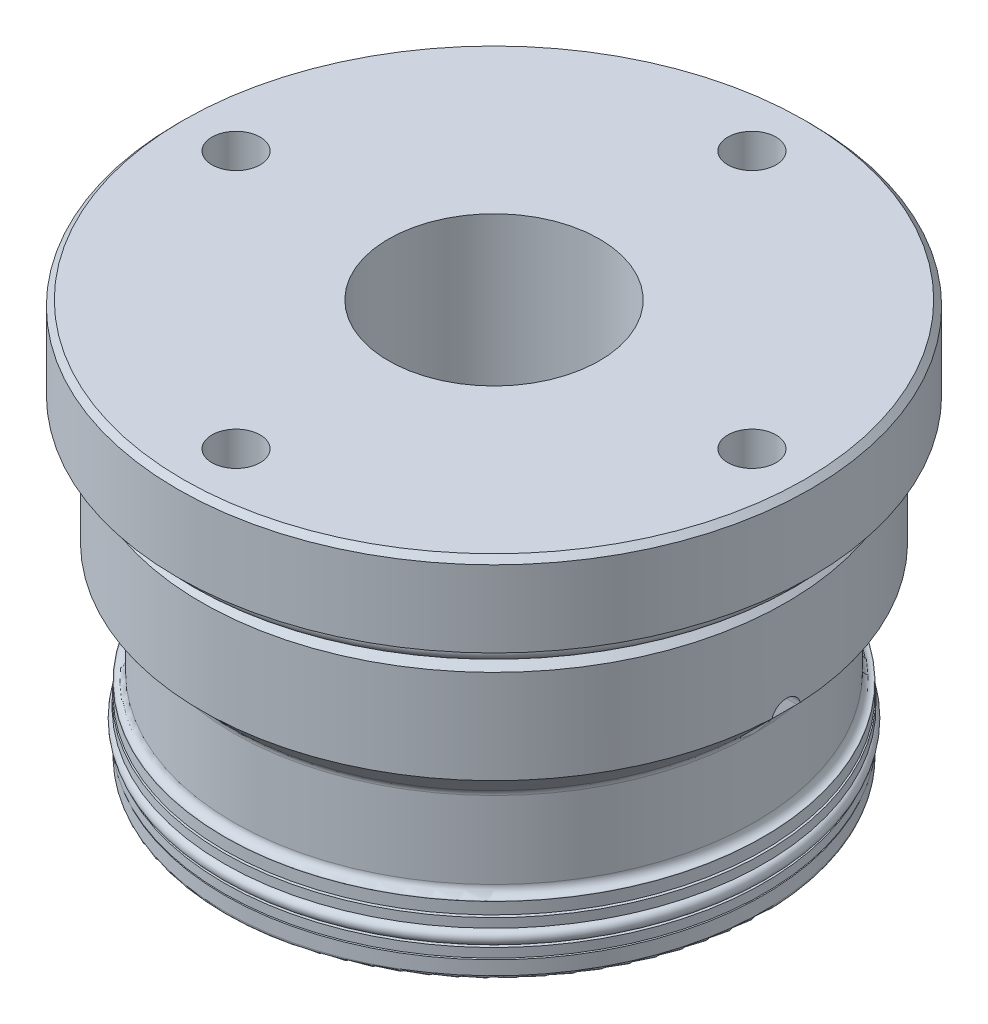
from build123d import *

# Parameters (mm, degrees)
FILLET1_R               = 1.143
FILLET2_R               = 0.381
FILLET3_R               = 0.508
CIRPATTERN1_COUNT       = 4
CHAMFER1_SIZE           = 0.762000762
FILLET4_R               = 0.381
SKETCH5_R               = 1.3081
SKETCH6_R               = 0.889
SKETCH6_W               = 1.3462
SKETCH6_H               = 1.2446
CUT_EXTRUDE1_DEPTH      = 82.164576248
CUT_EXTRUDE1_DEPTH_BACK = 82.164576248
SKETCH7_R               = 1.9812
CUT_EXTRUDE3_START      = 35.2806
CUT_EXTRUDE3_DEPTH      = 35.2806


with BuildPart() as part:
    # Sketch1 → Revolve1 (revolve)
    with BuildSketch(Plane.XY, mode=Mode.PRIVATE) as revolve1_sk:
        Polygon((-30.1625, 0), (-30.1625, 27.432), (-14.2875, 27.432), (-14.2875, 53.975), (-42.8625, 53.975), (-42.8625, 42.8752), (-39.5986, 42.8752), (-39.5986, 25.5905), (-35.2806, 21.2725), (-35.2806, 9.2202), (-36.4744, 9.2202), (-36.4744, 7.6454), (-35.2171, 7.6454), (-35.2171, 2.3876), (-36.4744, 2.3876), (-36.4744, 0), align=None)
    revolve(revolve1_sk.sketch.rotate(Axis((0, 0, 0), (0, 1, 0)), 270), axis=Axis((0, 0, 0), (0, 1, 0)))

    # Fillet1
    fillet1_edges = [part.edges().sort_by_distance(p)[0] for p in [
        (0, 9.2202, 35.2806),
        (0, 21.2725, 35.2806),
    ]]
    fillet(fillet1_edges, radius=FILLET1_R)

    # Fillet2
    fillet2_edges = [part.edges().sort_by_distance(p)[0] for p in [
        (0, 2.3876, 35.2171),
        (0, 7.6454, 35.2171),
    ]]
    fillet(fillet2_edges, radius=FILLET2_R)

    # Fillet3
    fillet3_edges = [part.edges().sort_by_distance(p)[0] for p in [
        (0, 0, 36.4744),
    ]]
    fillet(fillet3_edges, radius=FILLET3_R)

    # Sketch2 → Hole1 (revolve, cut)
    with BuildSketch(Plane(origin=(34.925, 53.975, 0), x_dir=(0, 0, 1), z_dir=(1, 0, 0))):
        Polygon((0, 0), (0, 8.311148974), (3.2639, 6.35), (3.2639, 0), align=None)
    hole1 = revolve(axis=Axis((34.925, 58.219199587, 0), (0, -1, 0)), mode=Mode.SUBTRACT)

    # CirPattern1: Hole1 ×4 about axis
    cirpattern1_axis = Axis((0, 0, 0), (0, 1, 0))
    for i in range(1, CIRPATTERN1_COUNT):
        add(hole1.rotate(cirpattern1_axis, i * 360 / CIRPATTERN1_COUNT), mode=Mode.SUBTRACT)

    # Chamfer1
    chamfer1_edges = [part.edges().sort_by_distance(p)[0] for p in [
        (0, 53.975, 42.8625),
    ]]
    chamfer(chamfer1_edges, length=CHAMFER1_SIZE)

    # Sketch4 → Cut-Revolve1 (revolve, cut)
    with BuildSketch(Plane.XY, mode=Mode.PRIVATE) as cut_revolve1_sk:
        Polygon((-39.5986, 42.8752), (-39.5986, 38.2905), (-38.4683, 39.4208), (-38.4683, 42.8752), align=None)
    revolve(cut_revolve1_sk.sketch.rotate(Axis((0, 0, 0), (0, 1, 0)), 270), axis=Axis((0, 0, 0), (0, 1, 0)), mode=Mode.SUBTRACT)

    # Fillet4
    fillet4_edges = [part.edges().sort_by_distance(p)[0] for p in [
        (0, 42.8752, 38.4683),
        (0, 39.4208, 38.4683),
    ]]
    fillet(fillet4_edges, radius=FILLET4_R)

    # Sketch5 → Revolve2 (revolve)
    with BuildSketch(Plane.XY, mode=Mode.PRIVATE) as revolve2_sk:
        with Locations((-39.7383, 41.529)):
            Circle(SKETCH5_R)
    revolve(revolve2_sk.sketch.rotate(Axis((0, 0, 0), (0, 1, 0)), 270), axis=Axis((0, 0, 0), (0, 1, 0)))

    # Sketch6 → Revolve3 (revolve)
    with BuildSketch(Plane.XY, mode=Mode.PRIVATE) as revolve3_sk:
        with Locations((-36.0553, 4.9276)):
            Circle(SKETCH6_R)
        with Locations((-35.8902, 6.7691)):
            Rectangle(SKETCH6_W, SKETCH6_H)
        with Locations((-35.8902, 3.2639)):
            Rectangle(SKETCH6_W, SKETCH6_H)
    revolve(revolve3_sk.sketch.rotate(Axis((0, 0, 0), (0, 1, 0)), 270), axis=Axis((0, 0, 0), (0, 1, 0)))

    # Sketch7 → Cut-Extrude1 (cut, two sides: drawn at the far end of the back side and taken through both)
    with BuildSketch(Plane(origin=(0, 0, 0), x_dir=(0, 0, -1), z_dir=(1, 0, 0)).offset(-CUT_EXTRUDE1_DEPTH_BACK)):
        with Locations((0, 25.0698)):
            Circle(SKETCH7_R)
    extrude(amount=CUT_EXTRUDE1_DEPTH + CUT_EXTRUDE1_DEPTH_BACK, mode=Mode.SUBTRACT)

    # Sketch8 → Cut-Extrude3 (cut)
    with BuildSketch(Plane(origin=(0, 0, 0), x_dir=(0, 0, -1), z_dir=(1, 0, 0)).offset(CUT_EXTRUDE3_START)):
        with BuildLine():
            Line((-1.9812, 25.0698), (-1.9812, 20.3073))
            ThreePointArc((-1.9812, 20.3073), (0, 18.3261), (1.9812, 20.3073))
            Line((1.9812, 20.3073), (1.9812, 25.0698))
            ThreePointArc((1.9812, 25.0698), (0, 27.051), (-1.9812, 25.0698))
        make_face()
    cut_extrude3 = extrude(amount=CUT_EXTRUDE3_DEPTH, mode=Mode.SUBTRACT)

    # Mirror1: Cut-Extrude3 across plane
    add(cut_extrude3.mirror(Plane(origin=(0, 0, 0), x_dir=(0, 0, 1), z_dir=(1, 0, 0))), mode=Mode.SUBTRACT)


solid = part.part
